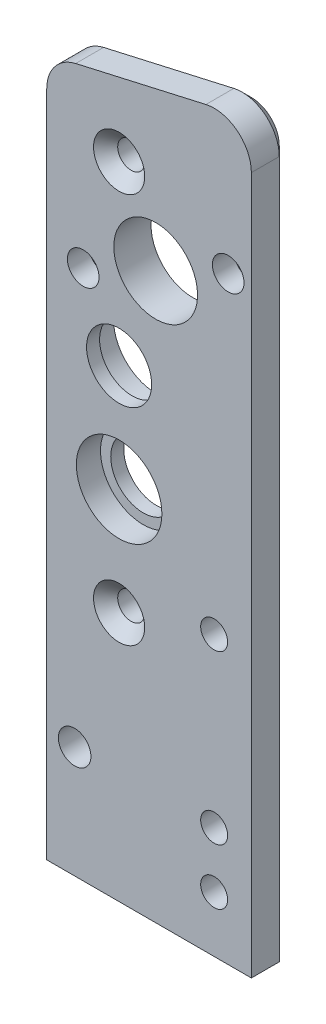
ISO-10303-21;
HEADER;
FILE_DESCRIPTION(('STEP AP214'),'2;1');
FILE_NAME('part.step','',(''),(''),'','','');
FILE_SCHEMA(('AUTOMOTIVE_DESIGN { 1 0 10303 214 1 1 1 1 }'));
ENDSEC;
DATA;
#1=APPLICATION_CONTEXT('core data for automotive mechanical design processes');
#2=APPLICATION_PROTOCOL_DEFINITION('international standard','automotive_design',2000,#1);
#3=PRODUCT_CONTEXT('',#1,'mechanical');
#4=PRODUCT('Part','Part','',(#3));
#5=PRODUCT_RELATED_PRODUCT_CATEGORY('part','',(#4));
#6=PRODUCT_DEFINITION_FORMATION('','',#4);
#7=PRODUCT_DEFINITION_CONTEXT('part definition',#1,'design');
#8=PRODUCT_DEFINITION('design','',#6,#7);
#9=PRODUCT_DEFINITION_SHAPE('','',#8);
#10=(LENGTH_UNIT() NAMED_UNIT(*) SI_UNIT(.MILLI.,.METRE.));
#11=(NAMED_UNIT(*) PLANE_ANGLE_UNIT() SI_UNIT($,.RADIAN.));
#12=(NAMED_UNIT(*) SI_UNIT($,.STERADIAN.) SOLID_ANGLE_UNIT());
#13=UNCERTAINTY_MEASURE_WITH_UNIT(LENGTH_MEASURE(1.E-05),#10,'distance_accuracy_value','');
#14=(GEOMETRIC_REPRESENTATION_CONTEXT(3) GLOBAL_UNCERTAINTY_ASSIGNED_CONTEXT((#13)) GLOBAL_UNIT_ASSIGNED_CONTEXT((#10,
#11,#12)) REPRESENTATION_CONTEXT('',''));
#15=CARTESIAN_POINT('',(0.,0.,0.));
#16=DIRECTION('',(0.,0.,1.));
#17=DIRECTION('',(1.,0.,0.));
#18=AXIS2_PLACEMENT_3D('',#15,#16,#17);
#19=CARTESIAN_POINT('',(7.78086952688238,38.3937133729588,0.));
#20=DIRECTION('',(0.,0.,-1.));
#21=DIRECTION('',(-1.,0.,0.));
#22=AXIS2_PLACEMENT_3D('',#19,#20,#21);
#23=CYLINDRICAL_SURFACE('',#22,3.5);
#24=CARTESIAN_POINT('',(7.78086952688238,38.3937133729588,0.));
#25=DIRECTION('',(0.,0.,-1.));
#26=DIRECTION('',(-1.,0.,0.));
#27=AXIS2_PLACEMENT_3D('',#24,#25,#26);
#28=CIRCLE('',#27,3.5);
#29=CARTESIAN_POINT('',(4.28086952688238,38.3937133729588,0.));
#30=VERTEX_POINT('',#29);
#31=EDGE_CURVE('E190',#30,#30,#28,.T.);
#32=ORIENTED_EDGE('',*,*,#31,.T.);
#33=EDGE_LOOP('',(#32));
#34=FACE_BOUND('',#33,.T.);
#35=CARTESIAN_POINT('',(7.78086952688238,38.3937133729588,1.4));
#36=DIRECTION('',(0.,0.,1.));
#37=DIRECTION('',(1.,0.,0.));
#38=AXIS2_PLACEMENT_3D('',#35,#36,#37);
#39=CIRCLE('',#38,3.5);
#40=CARTESIAN_POINT('',(11.2808695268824,38.3937133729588,1.4));
#41=VERTEX_POINT('',#40);
#42=EDGE_CURVE('E49',#41,#41,#39,.F.);
#43=ORIENTED_EDGE('',*,*,#42,.F.);
#44=EDGE_LOOP('',(#43));
#45=FACE_BOUND('',#44,.T.);
#46=ADVANCED_FACE('F43',(#34,#45),#23,.F.);
#47=CARTESIAN_POINT('',(0.,0.,0.));
#48=DIRECTION('',(0.,0.,1.));
#49=DIRECTION('',(1.,0.,0.));
#50=AXIS2_PLACEMENT_3D('',#47,#48,#49);
#51=PLANE('',#50);
#52=CARTESIAN_POINT('',(3.,12.,0.));
#53=DIRECTION('',(0.,0.,-1.));
#54=DIRECTION('',(-1.,0.,0.));
#55=AXIS2_PLACEMENT_3D('',#52,#53,#54);
#56=CIRCLE('',#55,1.74999999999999);
#57=CARTESIAN_POINT('',(1.25000000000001,12.,0.));
#58=VERTEX_POINT('',#57);
#59=EDGE_CURVE('E502',#58,#58,#56,.T.);
#60=ORIENTED_EDGE('',*,*,#59,.F.);
#61=EDGE_LOOP('',(#60));
#62=FACE_BOUND('',#61,.T.);
#63=CARTESIAN_POINT('',(7.7808695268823,68.8937133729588,0.));
#64=DIRECTION('',(0.,0.,1.));
#65=DIRECTION('',(1.,0.,0.));
#66=AXIS2_PLACEMENT_3D('',#63,#64,#65);
#67=CIRCLE('',#66,1.45);
#68=CARTESIAN_POINT('',(9.2308695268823,68.8937133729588,0.));
#69=VERTEX_POINT('',#68);
#70=EDGE_CURVE('E478',#69,#69,#67,.T.);
#71=ORIENTED_EDGE('',*,*,#70,.T.);
#72=EDGE_LOOP('',(#71));
#73=FACE_BOUND('',#72,.T.);
#74=CARTESIAN_POINT('',(7.78086952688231,26.8937133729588,0.));
#75=DIRECTION('',(0.,0.,1.));
#76=DIRECTION('',(1.,0.,0.));
#77=AXIS2_PLACEMENT_3D('',#74,#75,#76);
#78=CIRCLE('',#77,1.45);
#79=CARTESIAN_POINT('',(9.23086952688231,26.8937133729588,0.));
#80=VERTEX_POINT('',#79);
#81=EDGE_CURVE('E463',#80,#80,#78,.T.);
#82=ORIENTED_EDGE('',*,*,#81,.T.);
#83=EDGE_LOOP('',(#82));
#84=FACE_BOUND('',#83,.T.);
#85=CARTESIAN_POINT('',(7.7808695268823,49.8937133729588,0.));
#86=DIRECTION('',(0.,0.,-1.));
#87=DIRECTION('',(-1.,0.,0.));
#88=AXIS2_PLACEMENT_3D('',#85,#86,#87);
#89=CIRCLE('',#88,4.6);
#90=CARTESIAN_POINT('',(3.1808695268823,49.8937133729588,0.));
#91=VERTEX_POINT('',#90);
#92=EDGE_CURVE('E459',#91,#91,#89,.T.);
#93=ORIENTED_EDGE('',*,*,#92,.F.);
#94=EDGE_LOOP('',(#93));
#95=FACE_BOUND('',#94,.T.);
#96=CARTESIAN_POINT('',(18.,30.,0.));
#97=DIRECTION('',(0.,0.,-1.));
#98=DIRECTION('',(-1.,0.,0.));
#99=AXIS2_PLACEMENT_3D('',#96,#97,#98);
#100=CIRCLE('',#99,2.75);
#101=CARTESIAN_POINT('',(15.25,30.,0.));
#102=VERTEX_POINT('',#101);
#103=EDGE_CURVE('E446',#102,#102,#100,.T.);
#104=ORIENTED_EDGE('',*,*,#103,.F.);
#105=EDGE_LOOP('',(#104));
#106=FACE_BOUND('',#105,.T.);
#107=ORIENTED_EDGE('',*,*,#31,.F.);
#108=EDGE_LOOP('',(#107));
#109=FACE_BOUND('',#108,.T.);
#110=CARTESIAN_POINT('',(18.,12.,0.));
#111=DIRECTION('',(0.,0.,-1.));
#112=DIRECTION('',(-1.,0.,0.));
#113=AXIS2_PLACEMENT_3D('',#110,#111,#112);
#114=CIRCLE('',#113,2.75);
#115=CARTESIAN_POINT('',(15.25,12.,0.));
#116=VERTEX_POINT('',#115);
#117=EDGE_CURVE('E382',#116,#116,#114,.T.);
#118=ORIENTED_EDGE('',*,*,#117,.F.);
#119=EDGE_LOOP('',(#118));
#120=FACE_BOUND('',#119,.T.);
#121=CARTESIAN_POINT('',(18.,6.,0.));
#122=DIRECTION('',(0.,0.,-1.));
#123=DIRECTION('',(-1.,0.,0.));
#124=AXIS2_PLACEMENT_3D('',#121,#122,#123);
#125=CIRCLE('',#124,2.75);
#126=CARTESIAN_POINT('',(15.25,6.,0.));
#127=VERTEX_POINT('',#126);
#128=EDGE_CURVE('E394',#127,#127,#125,.T.);
#129=ORIENTED_EDGE('',*,*,#128,.F.);
#130=EDGE_LOOP('',(#129));
#131=FACE_BOUND('',#130,.T.);
#132=CARTESIAN_POINT('',(11.7141011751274,60.7001785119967,0.));
#133=DIRECTION('',(0.,0.,-1.));
#134=DIRECTION('',(-1.,0.,0.));
#135=AXIS2_PLACEMENT_3D('',#132,#133,#134);
#136=CIRCLE('',#135,4.49999999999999);
#137=CARTESIAN_POINT('',(7.21410117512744,60.7001785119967,0.));
#138=VERTEX_POINT('',#137);
#139=EDGE_CURVE('E418',#138,#138,#136,.T.);
#140=ORIENTED_EDGE('',*,*,#139,.F.);
#141=EDGE_LOOP('',(#140));
#142=FACE_BOUND('',#141,.T.);
#143=CARTESIAN_POINT('',(19.5083481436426,64.3346955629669,0.));
#144=DIRECTION('',(0.,0.,-1.));
#145=DIRECTION('',(-1.,0.,0.));
#146=AXIS2_PLACEMENT_3D('',#143,#144,#145);
#147=CIRCLE('',#146,3.36);
#148=CARTESIAN_POINT('',(21.,61.3239523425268,0.));
#149=VERTEX_POINT('',#148);
#150=CARTESIAN_POINT('',(21.,67.3454387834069,0.));
#151=VERTEX_POINT('',#150);
#152=EDGE_CURVE('E60',#149,#151,#147,.T.);
#153=ORIENTED_EDGE('',*,*,#152,.F.);
#154=DIRECTION('',(0.,-1.,0.));
#155=VECTOR('',#154,1.);
#156=CARTESIAN_POINT('',(21.,0.,0.));
#157=LINE('',#156,#155);
#158=CARTESIAN_POINT('',(21.,0.,0.));
#159=VERTEX_POINT('',#158);
#160=EDGE_CURVE('E141',#149,#159,#157,.T.);
#161=ORIENTED_EDGE('',*,*,#160,.T.);
#162=DIRECTION('',(1.,0.,0.));
#163=VECTOR('',#162,1.);
#164=CARTESIAN_POINT('',(0.,0.,0.));
#165=LINE('',#164,#163);
#166=CARTESIAN_POINT('',(1.00000000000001,0.,0.));
#167=VERTEX_POINT('',#166);
#168=EDGE_CURVE('E202',#167,#159,#165,.T.);
#169=ORIENTED_EDGE('',*,*,#168,.F.);
#170=DIRECTION('',(0.,1.,0.));
#171=VECTOR('',#170,1.);
#172=CARTESIAN_POINT('',(1.00000000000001,0.,0.));
#173=LINE('',#172,#171);
#174=CARTESIAN_POINT('',(1.00000000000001,55.4031178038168,0.));
#175=VERTEX_POINT('',#174);
#176=EDGE_CURVE('E169',#167,#175,#173,.T.);
#177=ORIENTED_EDGE('',*,*,#176,.T.);
#178=CARTESIAN_POINT('',(3.91985420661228,57.0656614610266,0.));
#179=DIRECTION('',(0.,0.,-1.));
#180=DIRECTION('',(-1.,0.,0.));
#181=AXIS2_PLACEMENT_3D('',#178,#179,#180);
#182=CIRCLE('',#181,3.36);
#183=CARTESIAN_POINT('',(1.00000000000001,58.7282051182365,0.));
#184=VERTEX_POINT('',#183);
#185=EDGE_CURVE('E67',#184,#175,#182,.T.);
#186=ORIENTED_EDGE('',*,*,#185,.F.);
#187=CARTESIAN_POINT('',(1.00000000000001,71.8070857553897,0.));
#188=VERTEX_POINT('',#187);
#189=EDGE_CURVE('E168',#184,#188,#173,.T.);
#190=ORIENTED_EDGE('',*,*,#189,.T.);
#191=CARTESIAN_POINT('',(4.,71.8070857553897,0.));
#192=DIRECTION('',(0.,0.,1.));
#193=DIRECTION('',(1.,0.,0.));
#194=AXIS2_PLACEMENT_3D('',#191,#192,#193);
#195=CIRCLE('',#194,2.99999999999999);
#196=CARTESIAN_POINT('',(3.3351366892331,74.732484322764,0.));
#197=VERTEX_POINT('',#196);
#198=EDGE_CURVE('E165',#188,#197,#195,.F.);
#199=ORIENTED_EDGE('',*,*,#198,.T.);
#200=DIRECTION('',(0.97513285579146,0.221621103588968,0.));
#201=VECTOR('',#200,1.);
#202=CARTESIAN_POINT('',(-15.9866303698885,70.3411736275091,0.));
#203=LINE('',#202,#201);
#204=CARTESIAN_POINT('',(17.3351366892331,77.9143025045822,0.));
#205=VERTEX_POINT('',#204);
#206=EDGE_CURVE('E162',#197,#205,#203,.T.);
#207=ORIENTED_EDGE('',*,*,#206,.T.);
#208=CARTESIAN_POINT('',(18.,74.9889039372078,0.));
#209=DIRECTION('',(0.,0.,1.));
#210=DIRECTION('',(1.,0.,0.));
#211=AXIS2_PLACEMENT_3D('',#208,#209,#210);
#212=CIRCLE('',#211,2.99999999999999);
#213=CARTESIAN_POINT('',(21.,74.9889039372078,0.));
#214=VERTEX_POINT('',#213);
#215=EDGE_CURVE('E156',#205,#214,#212,.F.);
#216=ORIENTED_EDGE('',*,*,#215,.T.);
#217=EDGE_CURVE('E143',#214,#151,#157,.T.);
#218=ORIENTED_EDGE('',*,*,#217,.T.);
#219=EDGE_LOOP('',(#153,#161,#169,#177,#186,#190,#199,#207,#216,#218));
#220=FACE_BOUND('',#219,.T.);
#221=ADVANCED_FACE('F139',(#62,#73,#84,#95,#106,#109,#120,#131,#142,#220),#51,.F.);
#222=CARTESIAN_POINT('',(0.,75.,4.));
#223=DIRECTION('',(1.,0.,0.));
#224=DIRECTION('',(0.,1.,0.));
#225=AXIS2_PLACEMENT_3D('',#222,#223,#224);
#226=PLANE('',#225);
#227=DIRECTION('',(0.,0.,-1.));
#228=VECTOR('',#227,1.);
#229=CARTESIAN_POINT('',(0.,71.8070857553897,4.));
#230=LINE('',#229,#228);
#231=CARTESIAN_POINT('',(0.,71.8070857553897,4.));
#232=VERTEX_POINT('',#231);
#233=CARTESIAN_POINT('',(0.,71.8070857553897,1.));
#234=VERTEX_POINT('',#233);
#235=EDGE_CURVE('E333',#232,#234,#230,.T.);
#236=ORIENTED_EDGE('',*,*,#235,.T.);
#237=DIRECTION('',(0.,-1.,0.));
#238=VECTOR('',#237,1.);
#239=CARTESIAN_POINT('',(0.,75.,1.));
#240=LINE('',#239,#238);
#241=CARTESIAN_POINT('',(0.,0.,1.));
#242=VERTEX_POINT('',#241);
#243=EDGE_CURVE('E328',#234,#242,#240,.T.);
#244=ORIENTED_EDGE('',*,*,#243,.T.);
#245=DIRECTION('',(0.,0.,-1.));
#246=VECTOR('',#245,1.);
#247=CARTESIAN_POINT('',(0.,0.,4.));
#248=LINE('',#247,#246);
#249=CARTESIAN_POINT('',(0.,0.,4.));
#250=VERTEX_POINT('',#249);
#251=EDGE_CURVE('E314',#250,#242,#248,.T.);
#252=ORIENTED_EDGE('',*,*,#251,.F.);
#253=DIRECTION('',(0.,-1.,0.));
#254=VECTOR('',#253,1.);
#255=CARTESIAN_POINT('',(0.,75.,4.));
#256=LINE('',#255,#254);
#257=EDGE_CURVE('E359',#232,#250,#256,.T.);
#258=ORIENTED_EDGE('',*,*,#257,.F.);
#259=EDGE_LOOP('',(#236,#244,#252,#258));
#260=FACE_BOUND('',#259,.T.);
#261=ADVANCED_FACE('F277',(#260),#226,.F.);
#262=CARTESIAN_POINT('',(0.,0.,4.));
#263=DIRECTION('',(0.,1.,0.));
#264=DIRECTION('',(0.,0.,1.));
#265=AXIS2_PLACEMENT_3D('',#262,#263,#264);
#266=PLANE('',#265);
#267=CARTESIAN_POINT('',(4.,0.,2.));
#268=DIRECTION('',(0.,-1.,0.));
#269=DIRECTION('',(0.,0.,-1.));
#270=AXIS2_PLACEMENT_3D('',#267,#268,#269);
#271=CIRCLE('',#270,0.799999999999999);
#272=CARTESIAN_POINT('',(4.,0.,1.2));
#273=VERTEX_POINT('',#272);
#274=EDGE_CURVE('E410',#273,#273,#271,.T.);
#275=ORIENTED_EDGE('',*,*,#274,.F.);
#276=EDGE_LOOP('',(#275));
#277=FACE_BOUND('',#276,.T.);
#278=CARTESIAN_POINT('',(12.,0.,2.));
#279=DIRECTION('',(0.,-1.,0.));
#280=DIRECTION('',(0.,0.,-1.));
#281=AXIS2_PLACEMENT_3D('',#278,#279,#280);
#282=CIRCLE('',#281,0.799999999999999);
#283=CARTESIAN_POINT('',(12.,0.,1.2));
#284=VERTEX_POINT('',#283);
#285=EDGE_CURVE('E402',#284,#284,#282,.T.);
#286=ORIENTED_EDGE('',*,*,#285,.F.);
#287=EDGE_LOOP('',(#286));
#288=FACE_BOUND('',#287,.T.);
#289=ORIENTED_EDGE('',*,*,#251,.T.);
#290=DIRECTION('',(-0.70710678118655,0.,0.707106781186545));
#291=VECTOR('',#290,1.);
#292=CARTESIAN_POINT('',(0.,0.,1.));
#293=LINE('',#292,#291);
#294=EDGE_CURVE('E152',#242,#167,#293,.F.);
#295=ORIENTED_EDGE('',*,*,#294,.T.);
#296=ORIENTED_EDGE('',*,*,#168,.T.);
#297=DIRECTION('',(-0.70710678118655,0.,-0.707106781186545));
#298=VECTOR('',#297,1.);
#299=CARTESIAN_POINT('',(22.,0.,1.));
#300=LINE('',#299,#298);
#301=CARTESIAN_POINT('',(22.,0.,1.));
#302=VERTEX_POINT('',#301);
#303=EDGE_CURVE('E150',#159,#302,#300,.F.);
#304=ORIENTED_EDGE('',*,*,#303,.T.);
#305=DIRECTION('',(0.,0.,-1.));
#306=VECTOR('',#305,1.);
#307=CARTESIAN_POINT('',(22.,0.,4.));
#308=LINE('',#307,#306);
#309=CARTESIAN_POINT('',(22.,0.,4.));
#310=VERTEX_POINT('',#309);
#311=EDGE_CURVE('E352',#310,#302,#308,.T.);
#312=ORIENTED_EDGE('',*,*,#311,.F.);
#313=DIRECTION('',(1.,0.,0.));
#314=VECTOR('',#313,1.);
#315=CARTESIAN_POINT('',(0.,0.,4.));
#316=LINE('',#315,#314);
#317=EDGE_CURVE('E366',#250,#310,#316,.T.);
#318=ORIENTED_EDGE('',*,*,#317,.F.);
#319=EDGE_LOOP('',(#289,#295,#296,#304,#312,#318));
#320=FACE_BOUND('',#319,.T.);
#321=ADVANCED_FACE('F285',(#277,#288,#320),#266,.F.);
#322=CARTESIAN_POINT('',(22.,0.,4.));
#323=DIRECTION('',(-1.,0.,0.));
#324=DIRECTION('',(0.,0.,1.));
#325=AXIS2_PLACEMENT_3D('',#322,#323,#324);
#326=PLANE('',#325);
#327=ORIENTED_EDGE('',*,*,#311,.T.);
#328=DIRECTION('',(0.,1.,0.));
#329=VECTOR('',#328,1.);
#330=CARTESIAN_POINT('',(22.,0.,1.));
#331=LINE('',#330,#329);
#332=CARTESIAN_POINT('',(22.,74.9889039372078,1.));
#333=VERTEX_POINT('',#332);
#334=EDGE_CURVE('E182',#302,#333,#331,.T.);
#335=ORIENTED_EDGE('',*,*,#334,.T.);
#336=DIRECTION('',(0.,0.,-1.));
#337=VECTOR('',#336,1.);
#338=CARTESIAN_POINT('',(22.,74.9889039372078,4.));
#339=LINE('',#338,#337);
#340=CARTESIAN_POINT('',(22.,74.9889039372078,4.));
#341=VERTEX_POINT('',#340);
#342=EDGE_CURVE('E344',#333,#341,#339,.F.);
#343=ORIENTED_EDGE('',*,*,#342,.T.);
#344=DIRECTION('',(0.,1.,0.));
#345=VECTOR('',#344,1.);
#346=CARTESIAN_POINT('',(22.,0.,4.));
#347=LINE('',#346,#345);
#348=EDGE_CURVE('E362',#310,#341,#347,.T.);
#349=ORIENTED_EDGE('',*,*,#348,.F.);
#350=EDGE_LOOP('',(#327,#335,#343,#349));
#351=FACE_BOUND('',#350,.T.);
#352=ADVANCED_FACE('F281',(#351),#326,.F.);
#353=CARTESIAN_POINT('',(22.,80.,4.));
#354=DIRECTION('',(0.221621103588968,-0.97513285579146,0.));
#355=DIRECTION('',(0.97513285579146,0.221621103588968,0.));
#356=AXIS2_PLACEMENT_3D('',#353,#354,#355);
#357=PLANE('',#356);
#358=DIRECTION('',(0.,0.,-1.));
#359=VECTOR('',#358,1.);
#360=CARTESIAN_POINT('',(17.1135155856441,78.8894353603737,4.));
#361=LINE('',#360,#359);
#362=CARTESIAN_POINT('',(17.1135155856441,78.8894353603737,4.));
#363=VERTEX_POINT('',#362);
#364=CARTESIAN_POINT('',(17.1135155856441,78.8894353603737,1.));
#365=VERTEX_POINT('',#364);
#366=EDGE_CURVE('E313',#363,#365,#361,.T.);
#367=ORIENTED_EDGE('',*,*,#366,.T.);
#368=DIRECTION('',(-0.97513285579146,-0.221621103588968,0.));
#369=VECTOR('',#368,1.);
#370=CARTESIAN_POINT('',(22.,80.,1.));
#371=LINE('',#370,#369);
#372=CARTESIAN_POINT('',(3.11351558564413,75.7076171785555,1.));
#373=VERTEX_POINT('',#372);
#374=EDGE_CURVE('E176',#365,#373,#371,.T.);
#375=ORIENTED_EDGE('',*,*,#374,.T.);
#376=DIRECTION('',(0.,0.,-1.));
#377=VECTOR('',#376,1.);
#378=CARTESIAN_POINT('',(3.11351558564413,75.7076171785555,4.));
#379=LINE('',#378,#377);
#380=CARTESIAN_POINT('',(3.11351558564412,75.7076171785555,4.));
#381=VERTEX_POINT('',#380);
#382=EDGE_CURVE('E304',#373,#381,#379,.F.);
#383=ORIENTED_EDGE('',*,*,#382,.T.);
#384=DIRECTION('',(-0.97513285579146,-0.221621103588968,0.));
#385=VECTOR('',#384,1.);
#386=CARTESIAN_POINT('',(22.,80.,4.));
#387=LINE('',#386,#385);
#388=EDGE_CURVE('E356',#363,#381,#387,.T.);
#389=ORIENTED_EDGE('',*,*,#388,.F.);
#390=EDGE_LOOP('',(#367,#375,#383,#389));
#391=FACE_BOUND('',#390,.T.);
#392=ADVANCED_FACE('F273',(#391),#357,.F.);
#393=CARTESIAN_POINT('',(0.,0.,4.));
#394=DIRECTION('',(0.,0.,1.));
#395=DIRECTION('',(1.,0.,0.));
#396=AXIS2_PLACEMENT_3D('',#393,#394,#395);
#397=PLANE('',#396);
#398=CARTESIAN_POINT('',(3.,12.,4.));
#399=DIRECTION('',(0.,0.,-1.));
#400=DIRECTION('',(-1.,0.,0.));
#401=AXIS2_PLACEMENT_3D('',#398,#399,#400);
#402=CIRCLE('',#401,1.74999999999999);
#403=CARTESIAN_POINT('',(1.25000000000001,12.,4.));
#404=VERTEX_POINT('',#403);
#405=EDGE_CURVE('E498',#404,#404,#402,.T.);
#406=ORIENTED_EDGE('',*,*,#405,.T.);
#407=EDGE_LOOP('',(#406));
#408=FACE_BOUND('',#407,.T.);
#409=CARTESIAN_POINT('',(7.7808695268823,49.8937133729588,4.));
#410=DIRECTION('',(0.,0.,-1.));
#411=DIRECTION('',(-1.,0.,0.));
#412=AXIS2_PLACEMENT_3D('',#409,#410,#411);
#413=CIRCLE('',#412,3.5);
#414=CARTESIAN_POINT('',(4.2808695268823,49.8937133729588,4.));
#415=VERTEX_POINT('',#414);
#416=EDGE_CURVE('E494',#415,#415,#413,.T.);
#417=ORIENTED_EDGE('',*,*,#416,.T.);
#418=EDGE_LOOP('',(#417));
#419=FACE_BOUND('',#418,.T.);
#420=CARTESIAN_POINT('',(7.7808695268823,68.8937133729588,4.));
#421=DIRECTION('',(0.,0.,1.));
#422=DIRECTION('',(1.,0.,0.));
#423=AXIS2_PLACEMENT_3D('',#420,#421,#422);
#424=CIRCLE('',#423,2.75);
#425=CARTESIAN_POINT('',(10.5308695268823,68.8937133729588,4.));
#426=VERTEX_POINT('',#425);
#427=EDGE_CURVE('E486',#426,#426,#424,.T.);
#428=ORIENTED_EDGE('',*,*,#427,.F.);
#429=EDGE_LOOP('',(#428));
#430=FACE_BOUND('',#429,.T.);
#431=CARTESIAN_POINT('',(7.78086952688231,26.8937133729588,4.));
#432=DIRECTION('',(0.,0.,1.));
#433=DIRECTION('',(1.,0.,0.));
#434=AXIS2_PLACEMENT_3D('',#431,#432,#433);
#435=CIRCLE('',#434,2.75);
#436=CARTESIAN_POINT('',(10.5308695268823,26.8937133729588,4.));
#437=VERTEX_POINT('',#436);
#438=EDGE_CURVE('E474',#437,#437,#435,.T.);
#439=ORIENTED_EDGE('',*,*,#438,.F.);
#440=EDGE_LOOP('',(#439));
#441=FACE_BOUND('',#440,.T.);
#442=CARTESIAN_POINT('',(7.78086952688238,38.3937133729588,4.));
#443=DIRECTION('',(0.,0.,1.));
#444=DIRECTION('',(1.,0.,0.));
#445=AXIS2_PLACEMENT_3D('',#442,#443,#444);
#446=CIRCLE('',#445,4.6);
#447=CARTESIAN_POINT('',(12.3808695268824,38.3937133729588,4.));
#448=VERTEX_POINT('',#447);
#449=EDGE_CURVE('E450',#448,#448,#446,.T.);
#450=ORIENTED_EDGE('',*,*,#449,.F.);
#451=EDGE_LOOP('',(#450));
#452=FACE_BOUND('',#451,.T.);
#453=CARTESIAN_POINT('',(18.,30.,4.));
#454=DIRECTION('',(0.,0.,-1.));
#455=DIRECTION('',(-1.,0.,0.));
#456=AXIS2_PLACEMENT_3D('',#453,#454,#455);
#457=CIRCLE('',#456,1.44999999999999);
#458=CARTESIAN_POINT('',(16.55,30.,4.));
#459=VERTEX_POINT('',#458);
#460=EDGE_CURVE('E146',#459,#459,#457,.T.);
#461=ORIENTED_EDGE('',*,*,#460,.T.);
#462=EDGE_LOOP('',(#461));
#463=FACE_BOUND('',#462,.T.);
#464=CARTESIAN_POINT('',(19.5083481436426,64.3346955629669,4.));
#465=DIRECTION('',(0.,0.,-1.));
#466=DIRECTION('',(-1.,0.,0.));
#467=AXIS2_PLACEMENT_3D('',#464,#465,#466);
#468=CIRCLE('',#467,1.69999999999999);
#469=CARTESIAN_POINT('',(17.8083481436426,64.3346955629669,4.));
#470=VERTEX_POINT('',#469);
#471=EDGE_CURVE('E432',#470,#470,#468,.T.);
#472=ORIENTED_EDGE('',*,*,#471,.T.);
#473=EDGE_LOOP('',(#472));
#474=FACE_BOUND('',#473,.T.);
#475=CARTESIAN_POINT('',(3.91985420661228,57.0656614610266,4.));
#476=DIRECTION('',(0.,0.,-1.));
#477=DIRECTION('',(-1.,0.,0.));
#478=AXIS2_PLACEMENT_3D('',#475,#476,#477);
#479=CIRCLE('',#478,1.69999999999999);
#480=CARTESIAN_POINT('',(2.21985420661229,57.0656614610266,4.));
#481=VERTEX_POINT('',#480);
#482=EDGE_CURVE('E422',#481,#481,#479,.T.);
#483=ORIENTED_EDGE('',*,*,#482,.T.);
#484=EDGE_LOOP('',(#483));
#485=FACE_BOUND('',#484,.T.);
#486=CARTESIAN_POINT('',(11.7141011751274,60.7001785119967,4.));
#487=DIRECTION('',(0.,0.,-1.));
#488=DIRECTION('',(-1.,0.,0.));
#489=AXIS2_PLACEMENT_3D('',#486,#487,#488);
#490=CIRCLE('',#489,4.5);
#491=CARTESIAN_POINT('',(7.21410117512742,60.7001785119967,4.));
#492=VERTEX_POINT('',#491);
#493=EDGE_CURVE('E414',#492,#492,#490,.T.);
#494=ORIENTED_EDGE('',*,*,#493,.T.);
#495=EDGE_LOOP('',(#494));
#496=FACE_BOUND('',#495,.T.);
#497=CARTESIAN_POINT('',(18.,6.,4.));
#498=DIRECTION('',(0.,0.,-1.));
#499=DIRECTION('',(-1.,0.,0.));
#500=AXIS2_PLACEMENT_3D('',#497,#498,#499);
#501=CIRCLE('',#500,1.45);
#502=CARTESIAN_POINT('',(16.55,6.,4.));
#503=VERTEX_POINT('',#502);
#504=EDGE_CURVE('E386',#503,#503,#501,.T.);
#505=ORIENTED_EDGE('',*,*,#504,.T.);
#506=EDGE_LOOP('',(#505));
#507=FACE_BOUND('',#506,.T.);
#508=CARTESIAN_POINT('',(18.,12.,4.));
#509=DIRECTION('',(0.,0.,-1.));
#510=DIRECTION('',(-1.,0.,0.));
#511=AXIS2_PLACEMENT_3D('',#508,#509,#510);
#512=CIRCLE('',#511,1.45);
#513=CARTESIAN_POINT('',(16.55,12.,4.));
#514=VERTEX_POINT('',#513);
#515=EDGE_CURVE('E374',#514,#514,#512,.T.);
#516=ORIENTED_EDGE('',*,*,#515,.T.);
#517=EDGE_LOOP('',(#516));
#518=FACE_BOUND('',#517,.T.);
#519=ORIENTED_EDGE('',*,*,#348,.T.);
#520=CARTESIAN_POINT('',(18.,74.9889039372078,4.));
#521=DIRECTION('',(0.,0.,1.));
#522=DIRECTION('',(1.,0.,0.));
#523=AXIS2_PLACEMENT_3D('',#520,#521,#522);
#524=CIRCLE('',#523,4.);
#525=EDGE_CURVE('E337',#341,#363,#524,.T.);
#526=ORIENTED_EDGE('',*,*,#525,.T.);
#527=ORIENTED_EDGE('',*,*,#388,.T.);
#528=CARTESIAN_POINT('',(4.,71.8070857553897,4.));
#529=DIRECTION('',(0.,0.,1.));
#530=DIRECTION('',(1.,0.,0.));
#531=AXIS2_PLACEMENT_3D('',#528,#529,#530);
#532=CIRCLE('',#531,4.);
#533=EDGE_CURVE('E309',#381,#232,#532,.T.);
#534=ORIENTED_EDGE('',*,*,#533,.T.);
#535=ORIENTED_EDGE('',*,*,#257,.T.);
#536=ORIENTED_EDGE('',*,*,#317,.T.);
#537=EDGE_LOOP('',(#519,#526,#527,#534,#535,#536));
#538=FACE_BOUND('',#537,.T.);
#539=ADVANCED_FACE('F269',(#408,#419,#430,#441,#452,#463,#474,#485,#496,#507,#518,#538),#397,.T.);
#540=CARTESIAN_POINT('',(18.,74.9889039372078,4.));
#541=DIRECTION('',(0.,0.,-1.));
#542=DIRECTION('',(-1.,0.,0.));
#543=AXIS2_PLACEMENT_3D('',#540,#541,#542);
#544=CYLINDRICAL_SURFACE('',#543,4.);
#545=ORIENTED_EDGE('',*,*,#342,.F.);
#546=CARTESIAN_POINT('',(18.,74.9889039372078,1.));
#547=DIRECTION('',(0.,0.,1.));
#548=DIRECTION('',(1.,0.,0.));
#549=AXIS2_PLACEMENT_3D('',#546,#547,#548);
#550=CIRCLE('',#549,4.);
#551=EDGE_CURVE('E179',#333,#365,#550,.T.);
#552=ORIENTED_EDGE('',*,*,#551,.T.);
#553=ORIENTED_EDGE('',*,*,#366,.F.);
#554=ORIENTED_EDGE('',*,*,#525,.F.);
#555=EDGE_LOOP('',(#545,#552,#553,#554));
#556=FACE_BOUND('',#555,.T.);
#557=ADVANCED_FACE('F272',(#556),#544,.T.);
#558=CARTESIAN_POINT('',(4.,71.8070857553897,4.));
#559=DIRECTION('',(0.,0.,-1.));
#560=DIRECTION('',(-1.,0.,0.));
#561=AXIS2_PLACEMENT_3D('',#558,#559,#560);
#562=CYLINDRICAL_SURFACE('',#561,4.);
#563=ORIENTED_EDGE('',*,*,#382,.F.);
#564=CARTESIAN_POINT('',(4.,71.8070857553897,1.));
#565=DIRECTION('',(0.,0.,1.));
#566=DIRECTION('',(1.,0.,0.));
#567=AXIS2_PLACEMENT_3D('',#564,#565,#566);
#568=CIRCLE('',#567,4.);
#569=EDGE_CURVE('E173',#373,#234,#568,.T.);
#570=ORIENTED_EDGE('',*,*,#569,.T.);
#571=ORIENTED_EDGE('',*,*,#235,.F.);
#572=ORIENTED_EDGE('',*,*,#533,.F.);
#573=EDGE_LOOP('',(#563,#570,#571,#572));
#574=FACE_BOUND('',#573,.T.);
#575=ADVANCED_FACE('F294',(#574),#562,.T.);
#576=CARTESIAN_POINT('',(22.,0.,1.));
#577=DIRECTION('',(-0.707106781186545,0.,0.70710678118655));
#578=DIRECTION('',(0.,1.,0.));
#579=AXIS2_PLACEMENT_3D('',#576,#577,#578);
#580=PLANE('',#579);
#581=CARTESIAN_POINT('',(20.9998,67.3457610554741,-0.00019999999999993));
#582=CARTESIAN_POINT('',(21.038318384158,67.2836926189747,0.0383183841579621));
#583=CARTESIAN_POINT('',(21.0761662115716,67.2207951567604,0.0761662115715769));
#584=CARTESIAN_POINT('',(21.1503724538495,67.0932351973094,0.150372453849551));
#585=CARTESIAN_POINT('',(21.1867303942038,67.0285721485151,0.186730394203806));
#586=CARTESIAN_POINT('',(21.2936084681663,66.8312842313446,0.293608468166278));
#587=CARTESIAN_POINT('',(21.3616072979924,66.6958792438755,0.361607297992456));
#588=CARTESIAN_POINT('',(21.490131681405,66.4152389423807,0.490131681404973));
#589=CARTESIAN_POINT('',(21.5505315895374,66.2698877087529,0.550531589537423));
#590=CARTESIAN_POINT('',(21.6604083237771,65.9713465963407,0.660408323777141));
#591=CARTESIAN_POINT('',(21.7099057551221,65.8181721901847,0.709905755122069));
#592=CARTESIAN_POINT('',(21.7788014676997,65.566237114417,0.778801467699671));
#593=CARTESIAN_POINT('',(21.8023841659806,65.4697473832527,0.802384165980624));
#594=CARTESIAN_POINT('',(21.8441462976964,65.2744277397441,0.844146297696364));
#595=CARTESIAN_POINT('',(21.8623255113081,65.1755977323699,0.862325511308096));
#596=CARTESIAN_POINT('',(21.8927054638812,64.9767304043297,0.892705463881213));
#597=CARTESIAN_POINT('',(21.9049415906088,64.8767039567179,0.904941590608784));
#598=CARTESIAN_POINT('',(21.9232449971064,64.6755232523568,0.923244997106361));
#599=CARTESIAN_POINT('',(21.9293125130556,64.5743690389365,0.929312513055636));
#600=CARTESIAN_POINT('',(21.9351059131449,64.3711791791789,0.93510591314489));
#601=CARTESIAN_POINT('',(21.934799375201,64.2691416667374,0.934799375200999));
#602=CARTESIAN_POINT('',(21.92777503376,64.0655128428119,0.927775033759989));
#603=CARTESIAN_POINT('',(21.9210572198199,63.9639215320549,0.921057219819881));
#604=CARTESIAN_POINT('',(21.9013979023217,63.7617387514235,0.901397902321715));
#605=CARTESIAN_POINT('',(21.8884432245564,63.6611498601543,0.888443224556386));
#606=CARTESIAN_POINT('',(21.8566795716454,63.4618306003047,0.856679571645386));
#607=CARTESIAN_POINT('',(21.837869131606,63.3631007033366,0.837869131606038));
#608=CARTESIAN_POINT('',(21.7889509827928,63.1411207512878,0.788950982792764));
#609=CARTESIAN_POINT('',(21.7571585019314,63.0186119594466,0.757158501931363));
#610=CARTESIAN_POINT('',(21.6859600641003,62.7781038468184,0.685960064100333));
#611=CARTESIAN_POINT('',(21.6465511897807,62.6601062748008,0.646551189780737));
#612=CARTESIAN_POINT('',(21.5611656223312,62.4286964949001,0.561165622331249));
#613=CARTESIAN_POINT('',(21.5151758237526,62.3152940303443,0.515175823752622));
#614=CARTESIAN_POINT('',(21.4177244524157,62.0933612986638,0.417724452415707));
#615=CARTESIAN_POINT('',(21.3662641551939,61.9848299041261,0.366264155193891));
#616=CARTESIAN_POINT('',(21.2636575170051,61.7821385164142,0.263657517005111));
#617=CARTESIAN_POINT('',(21.212910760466,61.6875706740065,0.212910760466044));
#618=CARTESIAN_POINT('',(21.1084773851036,61.5026557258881,0.108477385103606));
#619=CARTESIAN_POINT('',(21.0548101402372,61.4122867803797,0.0548101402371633));
#620=CARTESIAN_POINT('',(20.9998,61.3236300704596,-0.000199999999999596));
#621=B_SPLINE_CURVE_WITH_KNOTS('',3,(#581,#582,#583,#584,#585,#586,#587,#588,#589,#590,#591,
#592,#593,#594,#595,#596,#597,#598,#599,#600,#601,#602,#603,#604,#605,#606,#607,#608,#609,#610,
#611,#612,#613,#614,#615,#616,#617,#618,#619,#620),.UNSPECIFIED.,.F.,.F.,(4,2,2,2,2,2,2,2,2,2,2,
2,2,2,2,2,2,2,2,4),(0.,0.247727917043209,0.495534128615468,0.993222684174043,1.4982847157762,
2.00238385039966,2.30838804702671,2.61440469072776,2.91857612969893,3.22273592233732,
3.5284432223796,3.83415102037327,4.14050742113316,4.44694052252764,4.8378261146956,
5.22886172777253,5.62068718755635,6.01242148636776,6.368421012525,6.72229378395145),.UNSPECIFIED.);
#622=EDGE_CURVE('E11',#151,#149,#621,.T.);
#623=ORIENTED_EDGE('',*,*,#622,.F.);
#624=ORIENTED_EDGE('',*,*,#217,.F.);
#625=DIRECTION('',(-0.70710678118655,0.,-0.707106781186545));
#626=VECTOR('',#625,1.);
#627=CARTESIAN_POINT('',(22.,74.9889039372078,1.));
#628=LINE('',#627,#626);
#629=EDGE_CURVE('E198',#333,#214,#628,.T.);
#630=ORIENTED_EDGE('',*,*,#629,.F.);
#631=ORIENTED_EDGE('',*,*,#334,.F.);
#632=ORIENTED_EDGE('',*,*,#303,.F.);
#633=ORIENTED_EDGE('',*,*,#160,.F.);
#634=EDGE_LOOP('',(#623,#624,#630,#631,#632,#633));
#635=FACE_BOUND('',#634,.T.);
#636=ADVANCED_FACE('F46',(#635),#580,.F.);
#637=CARTESIAN_POINT('',(18.,74.9889039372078,0.));
#638=DIRECTION('',(0.,0.,1.));
#639=DIRECTION('',(1.,0.,0.));
#640=AXIS2_PLACEMENT_3D('',#637,#638,#639);
#641=CONICAL_SURFACE('',#640,2.99999999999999,0.785398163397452);
#642=ORIENTED_EDGE('',*,*,#629,.T.);
#643=ORIENTED_EDGE('',*,*,#215,.F.);
#644=DIRECTION('',(0.156709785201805,-0.689523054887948,-0.707106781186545));
#645=VECTOR('',#644,1.);
#646=CARTESIAN_POINT('',(17.1135155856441,78.8894353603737,1.));
#647=LINE('',#646,#645);
#648=EDGE_CURVE('E194',#365,#205,#647,.T.);
#649=ORIENTED_EDGE('',*,*,#648,.F.);
#650=ORIENTED_EDGE('',*,*,#551,.F.);
#651=EDGE_LOOP('',(#642,#643,#649,#650));
#652=FACE_BOUND('',#651,.T.);
#653=ADVANCED_FACE('F301',(#652),#641,.T.);
#654=CARTESIAN_POINT('',(22.,80.,1.));
#655=DIRECTION('',(0.156709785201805,-0.689523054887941,0.707106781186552));
#656=DIRECTION('',(-0.97513285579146,-0.221621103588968,0.));
#657=AXIS2_PLACEMENT_3D('',#654,#655,#656);
#658=PLANE('',#657);
#659=ORIENTED_EDGE('',*,*,#648,.T.);
#660=ORIENTED_EDGE('',*,*,#206,.F.);
#661=DIRECTION('',(0.156709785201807,-0.689523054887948,-0.707106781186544));
#662=VECTOR('',#661,1.);
#663=CARTESIAN_POINT('',(3.11351558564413,75.7076171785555,1.));
#664=LINE('',#663,#662);
#665=EDGE_CURVE('E189',#373,#197,#664,.T.);
#666=ORIENTED_EDGE('',*,*,#665,.F.);
#667=ORIENTED_EDGE('',*,*,#374,.F.);
#668=EDGE_LOOP('',(#659,#660,#666,#667));
#669=FACE_BOUND('',#668,.T.);
#670=ADVANCED_FACE('F319',(#669),#658,.F.);
#671=CARTESIAN_POINT('',(4.,71.8070857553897,0.));
#672=DIRECTION('',(0.,0.,1.));
#673=DIRECTION('',(1.,0.,0.));
#674=AXIS2_PLACEMENT_3D('',#671,#672,#673);
#675=CONICAL_SURFACE('',#674,2.99999999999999,0.785398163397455);
#676=ORIENTED_EDGE('',*,*,#665,.T.);
#677=ORIENTED_EDGE('',*,*,#198,.F.);
#678=DIRECTION('',(0.707106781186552,0.,-0.707106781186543));
#679=VECTOR('',#678,1.);
#680=CARTESIAN_POINT('',(0.,71.8070857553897,1.));
#681=LINE('',#680,#679);
#682=EDGE_CURVE('E185',#234,#188,#681,.T.);
#683=ORIENTED_EDGE('',*,*,#682,.F.);
#684=ORIENTED_EDGE('',*,*,#569,.F.);
#685=EDGE_LOOP('',(#676,#677,#683,#684));
#686=FACE_BOUND('',#685,.T.);
#687=ADVANCED_FACE('F323',(#686),#675,.T.);
#688=CARTESIAN_POINT('',(0.,75.,1.));
#689=DIRECTION('',(0.707106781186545,0.,0.70710678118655));
#690=DIRECTION('',(0.,-1.,0.));
#691=AXIS2_PLACEMENT_3D('',#688,#689,#690);
#692=PLANE('',#691);
#693=CARTESIAN_POINT('',(1.00020000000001,55.4023625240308,-0.000200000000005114));
#694=CARTESIAN_POINT('',(0.982669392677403,55.4685490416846,0.0173306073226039));
#695=CARTESIAN_POINT('',(0.966058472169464,55.5352173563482,0.0339415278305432));
#696=CARTESIAN_POINT('',(0.934774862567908,55.6694698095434,0.0652251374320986));
#697=CARTESIAN_POINT('',(0.920102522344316,55.7370541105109,0.079897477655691));
#698=CARTESIAN_POINT('',(0.879130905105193,55.9411719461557,0.120869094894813));
#699=CARTESIAN_POINT('',(0.855902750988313,56.078974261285,0.144097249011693));
#700=CARTESIAN_POINT('',(0.81898622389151,56.3524584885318,0.181013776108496));
#701=CARTESIAN_POINT('',(0.805011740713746,56.4880632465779,0.194988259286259));
#702=CARTESIAN_POINT('',(0.785868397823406,56.7604497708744,0.2141316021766));
#703=CARTESIAN_POINT('',(0.780694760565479,56.8972308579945,0.219305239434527));
#704=CARTESIAN_POINT('',(0.779292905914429,57.1759724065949,0.220707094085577));
#705=CARTESIAN_POINT('',(0.783404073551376,57.3179365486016,0.21659592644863));
#706=CARTESIAN_POINT('',(0.801129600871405,57.6007451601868,0.198870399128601));
#707=CARTESIAN_POINT('',(0.814749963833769,57.7415888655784,0.185250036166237));
#708=CARTESIAN_POINT('',(0.851663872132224,58.0258083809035,0.148336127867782));
#709=CARTESIAN_POINT('',(0.875278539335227,58.1691009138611,0.12472146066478));
#710=CARTESIAN_POINT('',(0.917335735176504,58.3812682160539,0.0826642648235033));
#711=CARTESIAN_POINT('',(0.932453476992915,58.4515018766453,0.0675465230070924));
#712=CARTESIAN_POINT('',(0.964783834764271,58.5909835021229,0.035216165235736));
#713=CARTESIAN_POINT('',(0.981996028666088,58.6602316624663,0.018003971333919));
#714=CARTESIAN_POINT('',(1.00020000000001,58.7289603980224,-0.000200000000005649));
#715=B_SPLINE_CURVE_WITH_KNOTS('',3,(#693,#694,#695,#696,#697,#698,#699,#700,#701,#702,#703,
#704,#705,#706,#707,#708,#709,#710,#711,#712,#713,#714),.UNSPECIFIED.,.F.,.F.,(4,2,2,2,2,2,2,2,
2,2,4),(0.,0.212005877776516,0.424049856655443,0.848445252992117,1.25901597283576,
1.66936374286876,2.09495252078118,2.52081022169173,2.96153609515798,3.18172731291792,
3.40187423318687),.UNSPECIFIED.);
#716=EDGE_CURVE('E55',#175,#184,#715,.T.);
#717=ORIENTED_EDGE('',*,*,#716,.F.);
#718=ORIENTED_EDGE('',*,*,#176,.F.);
#719=ORIENTED_EDGE('',*,*,#294,.F.);
#720=ORIENTED_EDGE('',*,*,#243,.F.);
#721=ORIENTED_EDGE('',*,*,#682,.T.);
#722=ORIENTED_EDGE('',*,*,#189,.F.);
#723=EDGE_LOOP('',(#717,#718,#719,#720,#721,#722));
#724=FACE_BOUND('',#723,.T.);
#725=ADVANCED_FACE('F216',(#724),#692,.F.);
#726=CARTESIAN_POINT('',(18.,12.,0.));
#727=DIRECTION('',(0.,0.,-1.));
#728=DIRECTION('',(-1.,0.,0.));
#729=AXIS2_PLACEMENT_3D('',#726,#727,#728);
#730=CYLINDRICAL_SURFACE('',#729,1.45);
#731=ORIENTED_EDGE('',*,*,#515,.F.);
#732=EDGE_LOOP('',(#731));
#733=FACE_BOUND('',#732,.T.);
#734=CARTESIAN_POINT('',(18.,12.,1.3));
#735=DIRECTION('',(0.,0.,-1.));
#736=DIRECTION('',(-1.,0.,0.));
#737=AXIS2_PLACEMENT_3D('',#734,#735,#736);
#738=CIRCLE('',#737,1.45);
#739=CARTESIAN_POINT('',(16.55,12.,1.3));
#740=VERTEX_POINT('',#739);
#741=EDGE_CURVE('E378',#740,#740,#738,.T.);
#742=ORIENTED_EDGE('',*,*,#741,.T.);
#743=EDGE_LOOP('',(#742));
#744=FACE_BOUND('',#743,.T.);
#745=ADVANCED_FACE('F261',(#733,#744),#730,.F.);
#746=CARTESIAN_POINT('',(18.,12.,0.));
#747=DIRECTION('',(0.,0.,-1.));
#748=DIRECTION('',(-1.,0.,0.));
#749=AXIS2_PLACEMENT_3D('',#746,#747,#748);
#750=CONICAL_SURFACE('',#749,2.75,0.785398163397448);
#751=ORIENTED_EDGE('',*,*,#741,.F.);
#752=EDGE_LOOP('',(#751));
#753=FACE_BOUND('',#752,.T.);
#754=ORIENTED_EDGE('',*,*,#117,.T.);
#755=EDGE_LOOP('',(#754));
#756=FACE_BOUND('',#755,.T.);
#757=ADVANCED_FACE('F257',(#753,#756),#750,.F.);
#758=CARTESIAN_POINT('',(18.,6.,0.));
#759=DIRECTION('',(0.,0.,-1.));
#760=DIRECTION('',(-1.,0.,0.));
#761=AXIS2_PLACEMENT_3D('',#758,#759,#760);
#762=CYLINDRICAL_SURFACE('',#761,1.45);
#763=ORIENTED_EDGE('',*,*,#504,.F.);
#764=EDGE_LOOP('',(#763));
#765=FACE_BOUND('',#764,.T.);
#766=CARTESIAN_POINT('',(18.,6.,1.3));
#767=DIRECTION('',(0.,0.,-1.));
#768=DIRECTION('',(-1.,0.,0.));
#769=AXIS2_PLACEMENT_3D('',#766,#767,#768);
#770=CIRCLE('',#769,1.45);
#771=CARTESIAN_POINT('',(16.55,6.,1.3));
#772=VERTEX_POINT('',#771);
#773=EDGE_CURVE('E390',#772,#772,#770,.T.);
#774=ORIENTED_EDGE('',*,*,#773,.T.);
#775=EDGE_LOOP('',(#774));
#776=FACE_BOUND('',#775,.T.);
#777=ADVANCED_FACE('F253',(#765,#776),#762,.F.);
#778=CARTESIAN_POINT('',(18.,6.,0.));
#779=DIRECTION('',(0.,0.,-1.));
#780=DIRECTION('',(-1.,0.,0.));
#781=AXIS2_PLACEMENT_3D('',#778,#779,#780);
#782=CONICAL_SURFACE('',#781,2.75,0.785398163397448);
#783=ORIENTED_EDGE('',*,*,#773,.F.);
#784=EDGE_LOOP('',(#783));
#785=FACE_BOUND('',#784,.T.);
#786=ORIENTED_EDGE('',*,*,#128,.T.);
#787=EDGE_LOOP('',(#786));
#788=FACE_BOUND('',#787,.T.);
#789=ADVANCED_FACE('F249',(#785,#788),#782,.F.);
#790=CARTESIAN_POINT('',(12.,8.,2.));
#791=DIRECTION('',(0.,-1.,0.));
#792=DIRECTION('',(0.,0.,-1.));
#793=AXIS2_PLACEMENT_3D('',#790,#791,#792);
#794=CONICAL_SURFACE('',#793,0.799999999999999,1.02974425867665);
#795=CARTESIAN_POINT('',(12.,8.48068849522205,2.));
#796=VERTEX_POINT('',#795);
#797=VERTEX_LOOP('',#796);
#798=FACE_BOUND('',#797,.T.);
#799=CARTESIAN_POINT('',(12.,8.,2.));
#800=DIRECTION('',(0.,-1.,0.));
#801=DIRECTION('',(0.,0.,-1.));
#802=AXIS2_PLACEMENT_3D('',#799,#800,#801);
#803=CIRCLE('',#802,0.799999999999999);
#804=CARTESIAN_POINT('',(12.,8.,1.2));
#805=VERTEX_POINT('',#804);
#806=EDGE_CURVE('E398',#805,#805,#803,.T.);
#807=ORIENTED_EDGE('',*,*,#806,.T.);
#808=EDGE_LOOP('',(#807));
#809=FACE_BOUND('',#808,.T.);
#810=ADVANCED_FACE('F245',(#798,#809),#794,.F.);
#811=CARTESIAN_POINT('',(12.,0.,2.));
#812=DIRECTION('',(0.,-1.,0.));
#813=DIRECTION('',(0.,0.,-1.));
#814=AXIS2_PLACEMENT_3D('',#811,#812,#813);
#815=CYLINDRICAL_SURFACE('',#814,0.799999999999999);
#816=ORIENTED_EDGE('',*,*,#806,.F.);
#817=EDGE_LOOP('',(#816));
#818=FACE_BOUND('',#817,.T.);
#819=ORIENTED_EDGE('',*,*,#285,.T.);
#820=EDGE_LOOP('',(#819));
#821=FACE_BOUND('',#820,.T.);
#822=ADVANCED_FACE('F241',(#818,#821),#815,.F.);
#823=CARTESIAN_POINT('',(4.,8.,2.));
#824=DIRECTION('',(0.,-1.,0.));
#825=DIRECTION('',(0.,0.,-1.));
#826=AXIS2_PLACEMENT_3D('',#823,#824,#825);
#827=CONICAL_SURFACE('',#826,0.799999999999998,1.02974425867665);
#828=CARTESIAN_POINT('',(4.,8.48068849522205,2.));
#829=VERTEX_POINT('',#828);
#830=VERTEX_LOOP('',#829);
#831=FACE_BOUND('',#830,.T.);
#832=CARTESIAN_POINT('',(4.,8.,2.));
#833=DIRECTION('',(0.,-1.,0.));
#834=DIRECTION('',(0.,0.,-1.));
#835=AXIS2_PLACEMENT_3D('',#832,#833,#834);
#836=CIRCLE('',#835,0.799999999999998);
#837=CARTESIAN_POINT('',(4.,8.,1.2));
#838=VERTEX_POINT('',#837);
#839=EDGE_CURVE('E406',#838,#838,#836,.T.);
#840=ORIENTED_EDGE('',*,*,#839,.T.);
#841=EDGE_LOOP('',(#840));
#842=FACE_BOUND('',#841,.T.);
#843=ADVANCED_FACE('F237',(#831,#842),#827,.F.);
#844=CARTESIAN_POINT('',(4.,0.,2.));
#845=DIRECTION('',(0.,-1.,0.));
#846=DIRECTION('',(0.,0.,-1.));
#847=AXIS2_PLACEMENT_3D('',#844,#845,#846);
#848=CYLINDRICAL_SURFACE('',#847,0.799999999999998);
#849=ORIENTED_EDGE('',*,*,#839,.F.);
#850=EDGE_LOOP('',(#849));
#851=FACE_BOUND('',#850,.T.);
#852=ORIENTED_EDGE('',*,*,#274,.T.);
#853=EDGE_LOOP('',(#852));
#854=FACE_BOUND('',#853,.T.);
#855=ADVANCED_FACE('F233',(#851,#854),#848,.F.);
#856=CARTESIAN_POINT('',(11.7141011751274,60.7001785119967,0.));
#857=DIRECTION('',(0.,0.,-1.));
#858=DIRECTION('',(-1.,0.,0.));
#859=AXIS2_PLACEMENT_3D('',#856,#857,#858);
#860=CYLINDRICAL_SURFACE('',#859,4.5);
#861=ORIENTED_EDGE('',*,*,#493,.F.);
#862=EDGE_LOOP('',(#861));
#863=FACE_BOUND('',#862,.T.);
#864=ORIENTED_EDGE('',*,*,#139,.T.);
#865=EDGE_LOOP('',(#864));
#866=FACE_BOUND('',#865,.T.);
#867=ADVANCED_FACE('F229',(#863,#866),#860,.F.);
#868=CARTESIAN_POINT('',(3.91985420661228,57.0656614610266,0.));
#869=DIRECTION('',(0.,0.,-1.));
#870=DIRECTION('',(-1.,0.,0.));
#871=AXIS2_PLACEMENT_3D('',#868,#869,#870);
#872=CYLINDRICAL_SURFACE('',#871,1.69999999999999);
#873=ORIENTED_EDGE('',*,*,#482,.F.);
#874=EDGE_LOOP('',(#873));
#875=FACE_BOUND('',#874,.T.);
#876=CARTESIAN_POINT('',(3.91985420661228,57.0656614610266,1.66));
#877=DIRECTION('',(0.,0.,-1.));
#878=DIRECTION('',(-1.,0.,0.));
#879=AXIS2_PLACEMENT_3D('',#876,#877,#878);
#880=CIRCLE('',#879,1.7);
#881=CARTESIAN_POINT('',(2.21985420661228,57.0656614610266,1.66));
#882=VERTEX_POINT('',#881);
#883=EDGE_CURVE('E426',#882,#882,#880,.T.);
#884=ORIENTED_EDGE('',*,*,#883,.T.);
#885=EDGE_LOOP('',(#884));
#886=FACE_BOUND('',#885,.T.);
#887=ADVANCED_FACE('F226',(#875,#886),#872,.F.);
#888=CARTESIAN_POINT('',(3.91985420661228,57.0656614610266,0.));
#889=DIRECTION('',(0.,0.,-1.));
#890=DIRECTION('',(-1.,0.,0.));
#891=AXIS2_PLACEMENT_3D('',#888,#889,#890);
#892=CONICAL_SURFACE('',#891,3.36,0.785398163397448);
#893=ORIENTED_EDGE('',*,*,#716,.T.);
#894=ORIENTED_EDGE('',*,*,#185,.T.);
#895=EDGE_LOOP('',(#893,#894));
#896=FACE_BOUND('',#895,.T.);
#897=ORIENTED_EDGE('',*,*,#883,.F.);
#898=EDGE_LOOP('',(#897));
#899=FACE_BOUND('',#898,.T.);
#900=ADVANCED_FACE('F220',(#896,#899),#892,.F.);
#901=CARTESIAN_POINT('',(19.5083481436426,64.3346955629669,0.));
#902=DIRECTION('',(0.,0.,-1.));
#903=DIRECTION('',(-1.,0.,0.));
#904=AXIS2_PLACEMENT_3D('',#901,#902,#903);
#905=CYLINDRICAL_SURFACE('',#904,1.69999999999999);
#906=ORIENTED_EDGE('',*,*,#471,.F.);
#907=EDGE_LOOP('',(#906));
#908=FACE_BOUND('',#907,.T.);
#909=CARTESIAN_POINT('',(19.5083481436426,64.3346955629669,1.66));
#910=DIRECTION('',(0.,0.,-1.));
#911=DIRECTION('',(-1.,0.,0.));
#912=AXIS2_PLACEMENT_3D('',#909,#910,#911);
#913=CIRCLE('',#912,1.7);
#914=CARTESIAN_POINT('',(17.8083481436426,64.3346955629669,1.66));
#915=VERTEX_POINT('',#914);
#916=EDGE_CURVE('E145',#915,#915,#913,.T.);
#917=ORIENTED_EDGE('',*,*,#916,.T.);
#918=EDGE_LOOP('',(#917));
#919=FACE_BOUND('',#918,.T.);
#920=ADVANCED_FACE('F225',(#908,#919),#905,.F.);
#921=CARTESIAN_POINT('',(19.5083481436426,64.3346955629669,0.));
#922=DIRECTION('',(0.,0.,-1.));
#923=DIRECTION('',(-1.,0.,0.));
#924=AXIS2_PLACEMENT_3D('',#921,#922,#923);
#925=CONICAL_SURFACE('',#924,3.36,0.785398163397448);
#926=ORIENTED_EDGE('',*,*,#622,.T.);
#927=ORIENTED_EDGE('',*,*,#152,.T.);
#928=EDGE_LOOP('',(#926,#927));
#929=FACE_BOUND('',#928,.T.);
#930=ORIENTED_EDGE('',*,*,#916,.F.);
#931=EDGE_LOOP('',(#930));
#932=FACE_BOUND('',#931,.T.);
#933=ADVANCED_FACE('F132',(#929,#932),#925,.F.);
#934=CARTESIAN_POINT('',(18.,30.,0.));
#935=DIRECTION('',(0.,0.,-1.));
#936=DIRECTION('',(-1.,0.,0.));
#937=AXIS2_PLACEMENT_3D('',#934,#935,#936);
#938=CYLINDRICAL_SURFACE('',#937,1.44999999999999);
#939=ORIENTED_EDGE('',*,*,#460,.F.);
#940=EDGE_LOOP('',(#939));
#941=FACE_BOUND('',#940,.T.);
#942=CARTESIAN_POINT('',(18.,30.,1.30000000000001));
#943=DIRECTION('',(0.,0.,-1.));
#944=DIRECTION('',(-1.,0.,0.));
#945=AXIS2_PLACEMENT_3D('',#942,#943,#944);
#946=CIRCLE('',#945,1.44999999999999);
#947=CARTESIAN_POINT('',(16.55,30.,1.30000000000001));
#948=VERTEX_POINT('',#947);
#949=EDGE_CURVE('E442',#948,#948,#946,.T.);
#950=ORIENTED_EDGE('',*,*,#949,.T.);
#951=EDGE_LOOP('',(#950));
#952=FACE_BOUND('',#951,.T.);
#953=ADVANCED_FACE('F545',(#941,#952),#938,.F.);
#954=CARTESIAN_POINT('',(18.,30.,0.));
#955=DIRECTION('',(0.,0.,-1.));
#956=DIRECTION('',(-1.,0.,0.));
#957=AXIS2_PLACEMENT_3D('',#954,#955,#956);
#958=CONICAL_SURFACE('',#957,2.75,0.785398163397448);
#959=ORIENTED_EDGE('',*,*,#949,.F.);
#960=EDGE_LOOP('',(#959));
#961=FACE_BOUND('',#960,.T.);
#962=ORIENTED_EDGE('',*,*,#103,.T.);
#963=EDGE_LOOP('',(#962));
#964=FACE_BOUND('',#963,.T.);
#965=ADVANCED_FACE('F535',(#961,#964),#958,.F.);
#966=CARTESIAN_POINT('',(7.78086952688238,38.3937133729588,1.4));
#967=DIRECTION('',(0.,0.,1.));
#968=DIRECTION('',(1.,0.,0.));
#969=AXIS2_PLACEMENT_3D('',#966,#967,#968);
#970=PLANE('',#969);
#971=CARTESIAN_POINT('',(7.78086952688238,38.3937133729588,1.4));
#972=DIRECTION('',(0.,0.,1.));
#973=DIRECTION('',(1.,0.,0.));
#974=AXIS2_PLACEMENT_3D('',#971,#972,#973);
#975=CIRCLE('',#974,4.6);
#976=CARTESIAN_POINT('',(12.3808695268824,38.3937133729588,1.4));
#977=VERTEX_POINT('',#976);
#978=EDGE_CURVE('E454',#977,#977,#975,.T.);
#979=ORIENTED_EDGE('',*,*,#978,.T.);
#980=EDGE_LOOP('',(#979));
#981=FACE_BOUND('',#980,.T.);
#982=ORIENTED_EDGE('',*,*,#42,.T.);
#983=EDGE_LOOP('',(#982));
#984=FACE_BOUND('',#983,.T.);
#985=ADVANCED_FACE('F532',(#981,#984),#970,.T.);
#986=CARTESIAN_POINT('',(7.78086952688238,38.3937133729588,1.4));
#987=DIRECTION('',(0.,0.,1.));
#988=DIRECTION('',(1.,0.,0.));
#989=AXIS2_PLACEMENT_3D('',#986,#987,#988);
#990=CYLINDRICAL_SURFACE('',#989,4.6);
#991=ORIENTED_EDGE('',*,*,#978,.F.);
#992=EDGE_LOOP('',(#991));
#993=FACE_BOUND('',#992,.T.);
#994=ORIENTED_EDGE('',*,*,#449,.T.);
#995=EDGE_LOOP('',(#994));
#996=FACE_BOUND('',#995,.T.);
#997=ADVANCED_FACE('F534',(#993,#996),#990,.F.);
#998=CARTESIAN_POINT('',(7.7808695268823,49.8937133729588,2.6));
#999=DIRECTION('',(0.,0.,-1.));
#1000=DIRECTION('',(-1.,0.,0.));
#1001=AXIS2_PLACEMENT_3D('',#998,#999,#1000);
#1002=CYLINDRICAL_SURFACE('',#1001,4.6);
#1003=CARTESIAN_POINT('',(7.7808695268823,49.8937133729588,2.6));
#1004=DIRECTION('',(0.,0.,-1.));
#1005=DIRECTION('',(-1.,0.,0.));
#1006=AXIS2_PLACEMENT_3D('',#1003,#1004,#1005);
#1007=CIRCLE('',#1006,4.6);
#1008=CARTESIAN_POINT('',(3.1808695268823,49.8937133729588,2.6));
#1009=VERTEX_POINT('',#1008);
#1010=EDGE_CURVE('E455',#1009,#1009,#1007,.T.);
#1011=ORIENTED_EDGE('',*,*,#1010,.F.);
#1012=EDGE_LOOP('',(#1011));
#1013=FACE_BOUND('',#1012,.T.);
#1014=ORIENTED_EDGE('',*,*,#92,.T.);
#1015=EDGE_LOOP('',(#1014));
#1016=FACE_BOUND('',#1015,.T.);
#1017=ADVANCED_FACE('F542',(#1013,#1016),#1002,.F.);
#1018=CARTESIAN_POINT('',(7.7808695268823,49.8937133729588,2.6));
#1019=DIRECTION('',(0.,0.,-1.));
#1020=DIRECTION('',(-1.,0.,0.));
#1021=AXIS2_PLACEMENT_3D('',#1018,#1019,#1020);
#1022=PLANE('',#1021);
#1023=CARTESIAN_POINT('',(7.7808695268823,49.8937133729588,2.6));
#1024=DIRECTION('',(0.,0.,-1.));
#1025=DIRECTION('',(-1.,0.,0.));
#1026=AXIS2_PLACEMENT_3D('',#1023,#1024,#1025);
#1027=CIRCLE('',#1026,3.49999999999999);
#1028=CARTESIAN_POINT('',(4.28086952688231,49.8937133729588,2.6));
#1029=VERTEX_POINT('',#1028);
#1030=EDGE_CURVE('E490',#1029,#1029,#1027,.T.);
#1031=ORIENTED_EDGE('',*,*,#1030,.F.);
#1032=EDGE_LOOP('',(#1031));
#1033=FACE_BOUND('',#1032,.T.);
#1034=ORIENTED_EDGE('',*,*,#1010,.T.);
#1035=EDGE_LOOP('',(#1034));
#1036=FACE_BOUND('',#1035,.T.);
#1037=ADVANCED_FACE('F702',(#1033,#1036),#1022,.T.);
#1038=CARTESIAN_POINT('',(7.78086952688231,26.8937133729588,4.));
#1039=DIRECTION('',(0.,0.,1.));
#1040=DIRECTION('',(1.,0.,0.));
#1041=AXIS2_PLACEMENT_3D('',#1038,#1039,#1040);
#1042=CYLINDRICAL_SURFACE('',#1041,1.45);
#1043=ORIENTED_EDGE('',*,*,#81,.F.);
#1044=EDGE_LOOP('',(#1043));
#1045=FACE_BOUND('',#1044,.T.);
#1046=CARTESIAN_POINT('',(7.78086952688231,26.8937133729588,2.7));
#1047=DIRECTION('',(0.,0.,1.));
#1048=DIRECTION('',(1.,0.,0.));
#1049=AXIS2_PLACEMENT_3D('',#1046,#1047,#1048);
#1050=CIRCLE('',#1049,1.45);
#1051=CARTESIAN_POINT('',(9.23086952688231,26.8937133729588,2.7));
#1052=VERTEX_POINT('',#1051);
#1053=EDGE_CURVE('E470',#1052,#1052,#1050,.T.);
#1054=ORIENTED_EDGE('',*,*,#1053,.T.);
#1055=EDGE_LOOP('',(#1054));
#1056=FACE_BOUND('',#1055,.T.);
#1057=ADVANCED_FACE('F709',(#1045,#1056),#1042,.F.);
#1058=CARTESIAN_POINT('',(7.78086952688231,26.8937133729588,4.));
#1059=DIRECTION('',(0.,0.,1.));
#1060=DIRECTION('',(1.,0.,0.));
#1061=AXIS2_PLACEMENT_3D('',#1058,#1059,#1060);
#1062=CONICAL_SURFACE('',#1061,2.75,0.785398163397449);
#1063=ORIENTED_EDGE('',*,*,#1053,.F.);
#1064=EDGE_LOOP('',(#1063));
#1065=FACE_BOUND('',#1064,.T.);
#1066=ORIENTED_EDGE('',*,*,#438,.T.);
#1067=EDGE_LOOP('',(#1066));
#1068=FACE_BOUND('',#1067,.T.);
#1069=ADVANCED_FACE('F714',(#1065,#1068),#1062,.F.);
#1070=CARTESIAN_POINT('',(7.7808695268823,68.8937133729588,4.));
#1071=DIRECTION('',(0.,0.,1.));
#1072=DIRECTION('',(1.,0.,0.));
#1073=AXIS2_PLACEMENT_3D('',#1070,#1071,#1072);
#1074=CYLINDRICAL_SURFACE('',#1073,1.45);
#1075=ORIENTED_EDGE('',*,*,#70,.F.);
#1076=EDGE_LOOP('',(#1075));
#1077=FACE_BOUND('',#1076,.T.);
#1078=CARTESIAN_POINT('',(7.7808695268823,68.8937133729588,2.7));
#1079=DIRECTION('',(0.,0.,1.));
#1080=DIRECTION('',(1.,0.,0.));
#1081=AXIS2_PLACEMENT_3D('',#1078,#1079,#1080);
#1082=CIRCLE('',#1081,1.45);
#1083=CARTESIAN_POINT('',(9.2308695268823,68.8937133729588,2.7));
#1084=VERTEX_POINT('',#1083);
#1085=EDGE_CURVE('E482',#1084,#1084,#1082,.T.);
#1086=ORIENTED_EDGE('',*,*,#1085,.T.);
#1087=EDGE_LOOP('',(#1086));
#1088=FACE_BOUND('',#1087,.T.);
#1089=ADVANCED_FACE('F724',(#1077,#1088),#1074,.F.);
#1090=CARTESIAN_POINT('',(7.7808695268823,68.8937133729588,4.));
#1091=DIRECTION('',(0.,0.,1.));
#1092=DIRECTION('',(1.,0.,0.));
#1093=AXIS2_PLACEMENT_3D('',#1090,#1091,#1092);
#1094=CONICAL_SURFACE('',#1093,2.75,0.785398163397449);
#1095=ORIENTED_EDGE('',*,*,#1085,.F.);
#1096=EDGE_LOOP('',(#1095));
#1097=FACE_BOUND('',#1096,.T.);
#1098=ORIENTED_EDGE('',*,*,#427,.T.);
#1099=EDGE_LOOP('',(#1098));
#1100=FACE_BOUND('',#1099,.T.);
#1101=ADVANCED_FACE('F734',(#1097,#1100),#1094,.F.);
#1102=CARTESIAN_POINT('',(7.7808695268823,49.8937133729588,0.));
#1103=DIRECTION('',(0.,0.,-1.));
#1104=DIRECTION('',(-1.,0.,0.));
#1105=AXIS2_PLACEMENT_3D('',#1102,#1103,#1104);
#1106=CYLINDRICAL_SURFACE('',#1105,3.49999999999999);
#1107=ORIENTED_EDGE('',*,*,#1030,.T.);
#1108=EDGE_LOOP('',(#1107));
#1109=FACE_BOUND('',#1108,.T.);
#1110=ORIENTED_EDGE('',*,*,#416,.F.);
#1111=EDGE_LOOP('',(#1110));
#1112=FACE_BOUND('',#1111,.T.);
#1113=ADVANCED_FACE('F744',(#1109,#1112),#1106,.F.);
#1114=CARTESIAN_POINT('',(3.,12.,0.));
#1115=DIRECTION('',(0.,0.,-1.));
#1116=DIRECTION('',(-1.,0.,0.));
#1117=AXIS2_PLACEMENT_3D('',#1114,#1115,#1116);
#1118=CYLINDRICAL_SURFACE('',#1117,1.74999999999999);
#1119=ORIENTED_EDGE('',*,*,#405,.F.);
#1120=EDGE_LOOP('',(#1119));
#1121=FACE_BOUND('',#1120,.T.);
#1122=ORIENTED_EDGE('',*,*,#59,.T.);
#1123=EDGE_LOOP('',(#1122));
#1124=FACE_BOUND('',#1123,.T.);
#1125=ADVANCED_FACE('F507',(#1121,#1124),#1118,.F.);
#1126=CLOSED_SHELL('',(#46,#221,#261,#321,#352,#392,#539,#557,#575,#636,#653,#670,#687,#725,
#745,#757,#777,#789,#810,#822,#843,#855,#867,#887,#900,#920,#933,#953,#965,#985,#997,#1017,
#1037,#1057,#1069,#1089,#1101,#1113,#1125));
#1127=MANIFOLD_SOLID_BREP('B2',#1126);
#1128=ADVANCED_BREP_SHAPE_REPRESENTATION('',(#18,#1127),#14);
#1129=SHAPE_DEFINITION_REPRESENTATION(#9,#1128);
ENDSEC;
END-ISO-10303-21;
